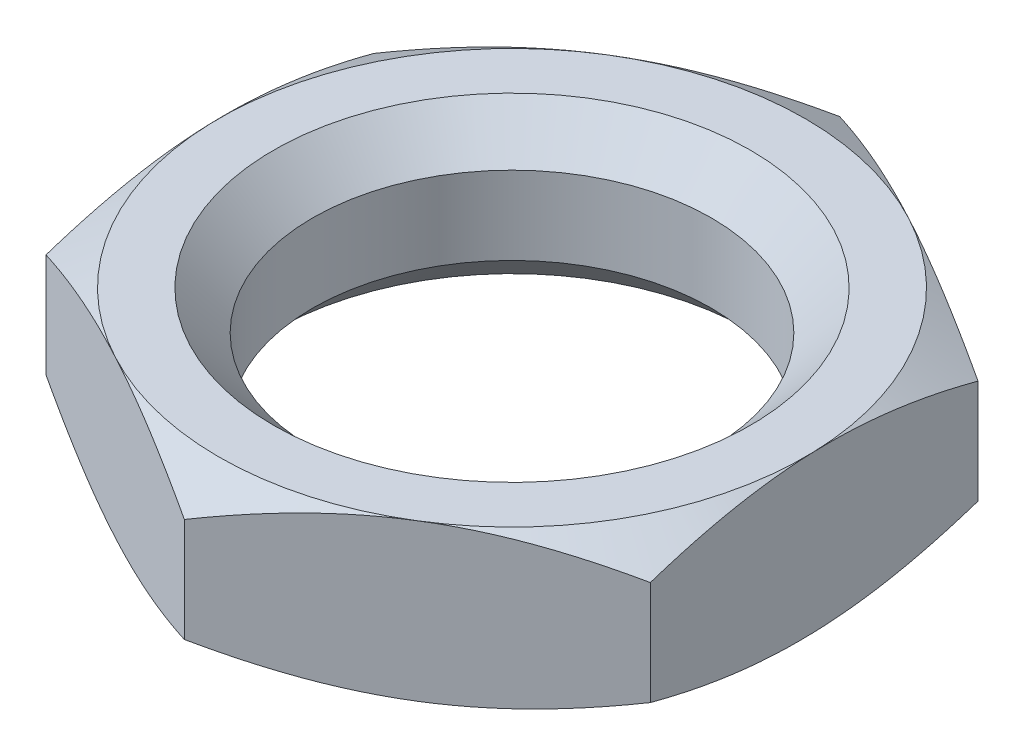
from build123d import *

# Parameters (mm, degrees)
EXTRUDE1_DEPTH          = 4
M12X1_75_TAPPED_HOLE1_D = 10.2
CHAMFER1_SIZE           = 1


with BuildPart() as part:
    # Sketch1 → Extrude1 (new body)
    with BuildSketch(Plane(origin=(0, 0, 0), x_dir=(1, 0, 0), z_dir=(0, 1, 0))):
        Polygon((7.360373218, 4.563431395), (-0.271860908, 8.655985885), (-7.632234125, 4.09255449), (-7.360373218, -4.563431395), (0.271860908, -8.655985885), (7.632234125, -4.09255449), align=None)
    extrude(amount=EXTRUDE1_DEPTH)

    # M12x1.75 Tapped Hole1 (through all)
    with Locations(Plane.ZX.offset(4)):
        with Locations((0, 0)):
            Hole(M12X1_75_TAPPED_HOLE1_D / 2)

    # Chamfer1
    chamfer1_edges = [part.edges().sort_by_distance(p)[0] for p in [
        (0, 4, 5.1),
        (0, 0, 5.1),
    ]]
    chamfer(chamfer1_edges, length=CHAMFER1_SIZE)

    # Sketch13 → Cut-Revolve1 (revolve, cut)
    with BuildSketch(Plane(origin=(0, 0, 0), x_dir=(-0.9995071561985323, 0, 0.03139179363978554), z_dir=(-0.03139179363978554, 0, -0.9995071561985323)), mode=Mode.PRIVATE) as cut_revolve1_sk:
        Polygon((-7.5, 4), (-10.5, 4), (-10.5, 2.267949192), align=None)
        Polygon((-7.5, 0), (-10.5, 0), (-10.5, 1.732050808), align=None)
    revolve(cut_revolve1_sk.sketch.rotate(Axis((0, 2.267949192, 0), (0, 1, 0)), 268.201087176), axis=Axis((0, 2.267949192, 0), (0, 1, 0)), mode=Mode.SUBTRACT)


solid = part.part
